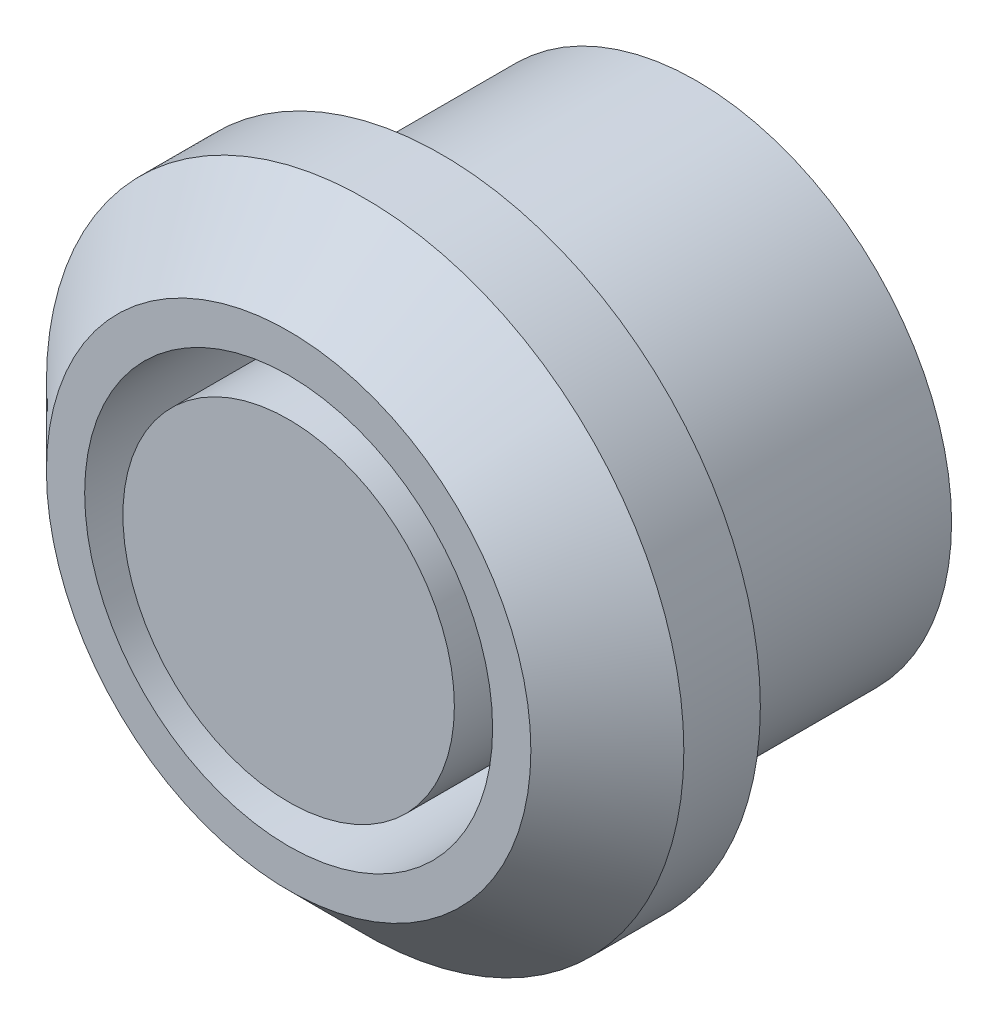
from build123d import *

# Parameters (mm, degrees)
ESQUISSE1_R             = 12.5
BASE_EXTRUSION_DEPTH    = 6
CHANFREIN1_SIZE         = 3
ESQUISSE2_R             = 10
BOSS_EXTRU_1_DEPTH      = 10
ESQUISSE3_R             = 8
ENL_V_MAT_EXTRU_1_DEPTH = 10
ESQUISSE4_R             = 6.5
BOSS_EXTRU_2_DEPTH      = 10


with BuildPart() as part:
    # Esquisse1 → Base-Extrusion (new body)
    with BuildSketch(Plane.XY):
        Circle(ESQUISSE1_R)
    extrude(amount=BASE_EXTRUSION_DEPTH)

    # Chanfrein1
    chanfrein1_edges = [part.edges().sort_by_distance(p)[0] for p in [
        (-12.5, 0, 6),
    ]]
    chamfer(chanfrein1_edges, length=CHANFREIN1_SIZE)

    # Esquisse2 → Boss.-Extru.1 (add)
    with BuildSketch(Plane(origin=(0, 0, 0), x_dir=(-1, 0, 0), z_dir=(0, 0, -1))):
        with Locations(Location((0, 0, 0), (0, 0, 180))):
            Circle(ESQUISSE2_R)
    extrude(amount=BOSS_EXTRU_1_DEPTH)

    # Esquisse3 → Enl_v. mat.-Extru.1 (cut)
    with BuildSketch(Plane.XY.offset(6)):
        Circle(ESQUISSE3_R)
    extrude(amount=-ENL_V_MAT_EXTRU_1_DEPTH, mode=Mode.SUBTRACT)

    # Esquisse4 → Boss.-Extru.2 (add)
    with BuildSketch(Plane.XY.offset(-4)):
        Circle(ESQUISSE4_R)
    extrude(amount=BOSS_EXTRU_2_DEPTH)


solid = part.part
